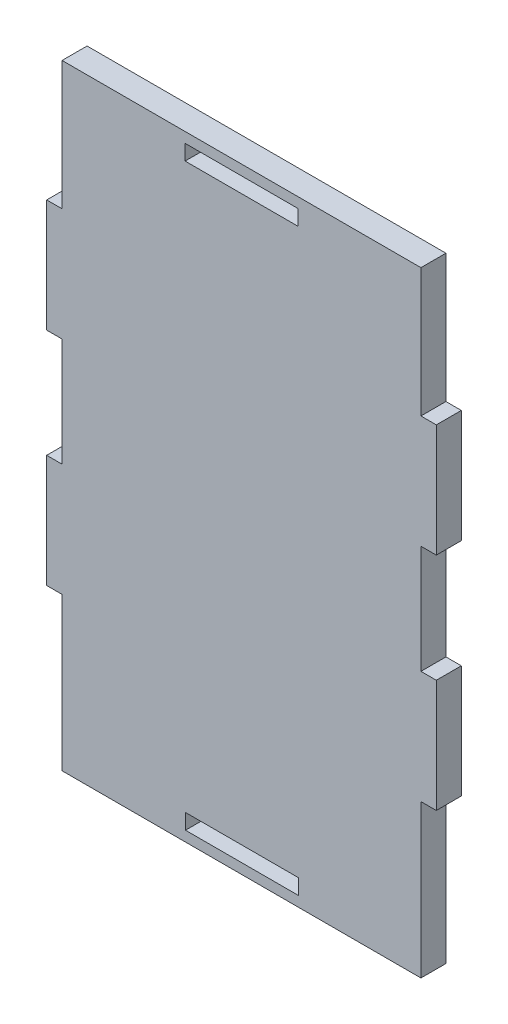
from build123d import *

# Parameters (mm, degrees)
SKETCH1_W           = 22
SKETCH1_H           = 3
BOSS_EXTRUDE1_DEPTH = 4.879348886


with BuildPart() as part:
    # Sketch1 → Boss-Extrude1 (new body)
    with BuildSketch(Plane.XY):
        Polygon((0, -47.06), (0, -68.2), (-3, -68.2), (-3, -90.2), (0, -90.2), (0, -120), (70, -120), (70, -90.2), (73, -90.2), (73, -68.2), (70, -68.2), (70, -47.06), (73, -47.06), (73, -25.06), (70, -25.06), (70, 0), (0, 0), (0, -25.06), (-3, -25.06), (-3, -47.06), align=None)
        with Locations((34.997934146, -3.5)):
            Rectangle(SKETCH1_W, SKETCH1_H, mode=Mode.SUBTRACT)
        with Locations((35.077303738, -116.5)):
            Rectangle(SKETCH1_W, SKETCH1_H, mode=Mode.SUBTRACT)
    extrude(amount=BOSS_EXTRUDE1_DEPTH)


solid = part.part
